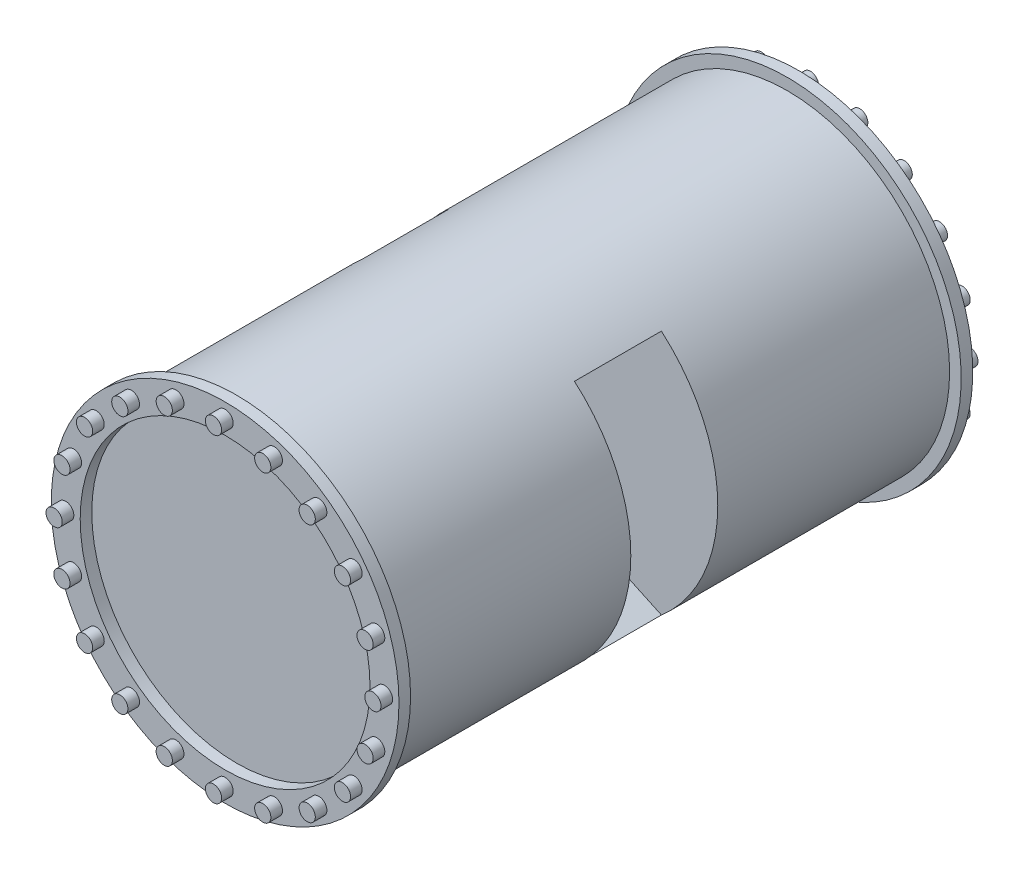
from build123d import *
from build123d.topology import SkipClean

# Parameters (mm, degrees)
SKETCH1_R            = 150
SKETCH1_R_2          = 125
BOSS_EXTRUDE1_DEPTH  = 10
SKETCH2_R            = 7
BOSS_EXTRUDE2_DEPTH  = 10
CIRPATTERN1_COUNT    = 20
SKETCH1_2_R          = 125
BOSS_EXTRUDE3_DEPTH  = 200
BOSS_EXTRUDE4_START  = 75
SKETCH3_R            = 20
BOSS_EXTRUDE4_DEPTH  = 75
BOSS_EXTRUDE5_START  = 200
SKETCH4_R            = 125
BOSS_EXTRUDE5_DEPTH  = 200
SKETCH5_R            = 140
BOSS_EXTRUDE6_DEPTH  = 200
BOSS_EXTRUDE7_DEPTH  = 75
SKETCH7_R            = 140
BOSS_EXTRUDE8_DEPTH  = 200
BOSS_EXTRUDE9_START  = 10
SKETCH8_R            = 150
SKETCH8_R_2          = 125
BOSS_EXTRUDE9_DEPTH  = 10
BOSS_EXTRUDE10_START = 10
SKETCH9_R            = 7
BOSS_EXTRUDE10_DEPTH = 10
CIRPATTERN2_COUNT    = 20


with BuildPart() as part:
    # Sketch1 → Boss-Extrude1 (new body)
    with BuildSketch(Plane.XY):
        Circle(SKETCH1_R)
        Circle(SKETCH1_R_2, mode=Mode.SUBTRACT)
    extrude(amount=BOSS_EXTRUDE1_DEPTH)

    # Sketch2 → Boss-Extrude2 (add)
    with BuildSketch(Plane.XY.offset(10)):
        with Locations((0, 137.5)):
            Circle(SKETCH2_R)
    boss_extrude2 = extrude(amount=BOSS_EXTRUDE2_DEPTH)

    # CirPattern1: Boss-Extrude2 ×20 about axis
    cirpattern1_axis = Axis((0, 0, 0), (0, 0, 1))
    for i in range(1, CIRPATTERN1_COUNT):
        add(boss_extrude2.rotate(cirpattern1_axis, i * 360 / CIRPATTERN1_COUNT))



with BuildPart() as body_2:
    # Sketch1_2 → Boss-Extrude3 (new body)
    with BuildSketch(Plane.XY):
        Circle(SKETCH1_2_R)
    extrude(amount=-BOSS_EXTRUDE3_DEPTH)

    # Sketch3 → Boss-Extrude4 (add)
    with BuildSketch(Plane(origin=(0, 0, -200), x_dir=(-1, 0, 0), z_dir=(0, 0, -1)).offset(BOSS_EXTRUDE4_START)):
        Circle(SKETCH3_R)
        with BuildLine():
            Line((-6.339273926, 66.405383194), (-76.286303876, 99.022218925))
            ThreePointArc((-76.286303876, 99.022218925), (0, 125), (76.286303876, 99.022218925))
            Line((76.286303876, 99.022218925), (6.339273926, 66.405383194))
            ThreePointArc((6.339273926, 66.405383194), (0, 65), (-6.339273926, 66.405383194))
        make_face()
        with BuildLine():
            Line((-6.339273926, -66.405383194), (-76.286303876, -99.022218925))
            ThreePointArc((-76.286303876, -99.022218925), (0, -125), (76.286303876, -99.022218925))
            Line((76.286303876, -99.022218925), (6.339273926, -66.405383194))
            ThreePointArc((6.339273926, -66.405383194), (0, -65), (-6.339273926, -66.405383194))
        make_face()
    extrude(amount=-BOSS_EXTRUDE4_DEPTH)

    # Sketch4 → Boss-Extrude5 (add)
    with BuildSketch(Plane(origin=(0, 0, -275), x_dir=(-1, 0, 0), z_dir=(0, 0, -1)).offset(BOSS_EXTRUDE5_START)):
        with Locations(Location((0, 0, 0), (0, 0, 180))):
            Circle(SKETCH4_R)
    extrude(amount=-BOSS_EXTRUDE5_DEPTH)


with BuildPart() as part_1:
    add(part.part)

    add(body_2.part)  # Boss-Extrude6 merges body 2
    # Sketch5 → Boss-Extrude6 (add)
    with BuildSketch(Plane(origin=(0, 0, 0), x_dir=(-1, 0, 0), z_dir=(0, 0, -1))):
        Circle(SKETCH5_R)
    extrude(amount=BOSS_EXTRUDE6_DEPTH)

    # Sketch6 → Boss-Extrude7 (add)
    with BuildSketch(Plane(origin=(0, 0, -200), x_dir=(-1, 0, 0), z_dir=(0, 0, -1))):
        with BuildLine():
            Line((-76.286303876, 99.022218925), (-91.383055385, 106.061949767))
            ThreePointArc((-91.383055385, 106.061949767), (0, 140), (91.383055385, 106.061949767))
            Line((91.383055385, 106.061949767), (76.286303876, 99.022218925))
            Line((76.286303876, 99.022218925), (-76.286303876, 99.022218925))
        make_face()
        with BuildLine():
            Line((-76.286303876, -99.022218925), (-91.383055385, -106.061949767))
            ThreePointArc((-91.383055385, -106.061949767), (0, -140), (91.383055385, -106.061949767))
            Line((91.383055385, -106.061949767), (76.286303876, -99.022218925))
            Line((76.286303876, -99.022218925), (-76.286303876, -99.022218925))
        make_face()
    extrude(amount=BOSS_EXTRUDE7_DEPTH)

    # Sketch7 → Boss-Extrude8 (add)
    with SkipClean():  # the faces are left unmerged after this step: merging them gives an invalid solid
        with BuildSketch(Plane(origin=(0, 0, -275), x_dir=(-1, 0, 0), z_dir=(0, 0, -1))):
            Circle(SKETCH7_R)
        extrude(amount=BOSS_EXTRUDE8_DEPTH)

    # Sketch8 → Boss-Extrude9 (add)
    with SkipClean():  # the faces are left unmerged after this step: merging them gives an invalid solid
        with BuildSketch(Plane(origin=(0, 0, -475), x_dir=(-1, 0, 0), z_dir=(0, 0, -1)).offset(BOSS_EXTRUDE9_START)):
            with Locations(Location((0, 0, 0), (0, 0, 180))):
                Circle(SKETCH8_R)
            with Locations(Location((0, 0, 0), (0, 0, 180))):
                Circle(SKETCH8_R_2, mode=Mode.SUBTRACT)
        extrude(amount=-BOSS_EXTRUDE9_DEPTH)

    # Sketch9 → Boss-Extrude10 (add)
    with SkipClean():  # the faces are left unmerged after this step: merging them gives an invalid solid
        with BuildSketch(Plane(origin=(0, 0, -485), x_dir=(-1, 0, 0), z_dir=(0, 0, -1)).offset(BOSS_EXTRUDE10_START)):
            with Locations(Location((0, 137.5, 0), (0, 0, 180))):
                Circle(SKETCH9_R)
        boss_extrude10 = extrude(amount=-BOSS_EXTRUDE10_DEPTH)

    # CirPattern2: Boss-Extrude10 ×20 about axis
    with SkipClean():  # the faces are left unmerged after this step: merging them gives an invalid solid
        cirpattern2_axis = Axis((0, 0, 0), (0, 0, 1))
        for i in range(1, CIRPATTERN2_COUNT):
            add(boss_extrude10.rotate(cirpattern2_axis, i * 360 / CIRPATTERN2_COUNT))


solid = part_1.part
